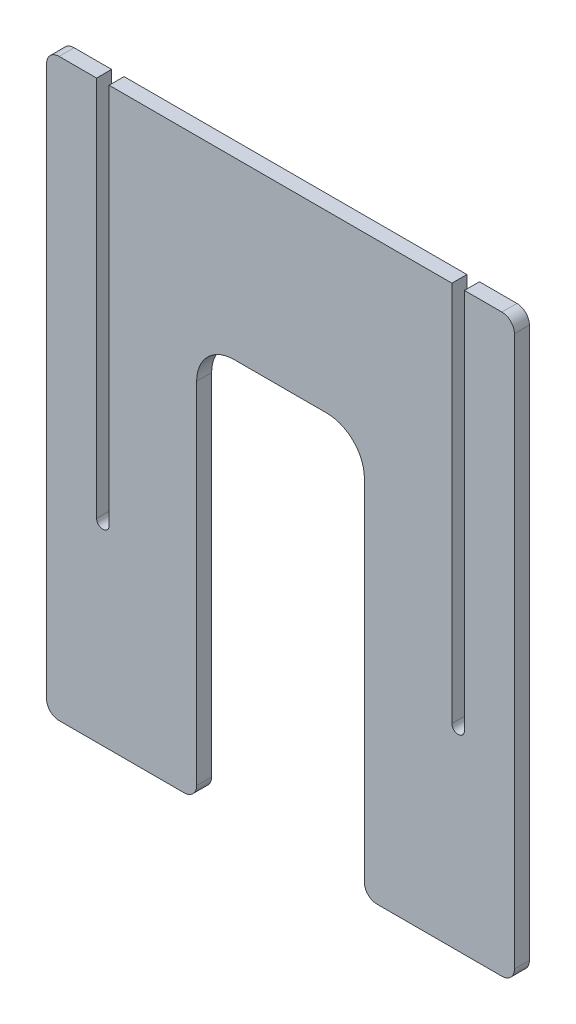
ISO-10303-21;
HEADER;
FILE_DESCRIPTION(('STEP AP214'),'2;1');
FILE_NAME('part.step','',(''),(''),'','','');
FILE_SCHEMA(('AUTOMOTIVE_DESIGN { 1 0 10303 214 1 1 1 1 }'));
ENDSEC;
DATA;
#1=APPLICATION_CONTEXT('core data for automotive mechanical design processes');
#2=APPLICATION_PROTOCOL_DEFINITION('international standard','automotive_design',2000,#1);
#3=PRODUCT_CONTEXT('',#1,'mechanical');
#4=PRODUCT('Part','Part','',(#3));
#5=PRODUCT_RELATED_PRODUCT_CATEGORY('part','',(#4));
#6=PRODUCT_DEFINITION_FORMATION('','',#4);
#7=PRODUCT_DEFINITION_CONTEXT('part definition',#1,'design');
#8=PRODUCT_DEFINITION('design','',#6,#7);
#9=PRODUCT_DEFINITION_SHAPE('','',#8);
#10=(LENGTH_UNIT() NAMED_UNIT(*) SI_UNIT(.MILLI.,.METRE.));
#11=(NAMED_UNIT(*) PLANE_ANGLE_UNIT() SI_UNIT($,.RADIAN.));
#12=(NAMED_UNIT(*) SI_UNIT($,.STERADIAN.) SOLID_ANGLE_UNIT());
#13=UNCERTAINTY_MEASURE_WITH_UNIT(LENGTH_MEASURE(1.E-05),#10,'distance_accuracy_value','');
#14=(GEOMETRIC_REPRESENTATION_CONTEXT(3) GLOBAL_UNCERTAINTY_ASSIGNED_CONTEXT((#13)) GLOBAL_UNIT_ASSIGNED_CONTEXT((#10,
#11,#12)) REPRESENTATION_CONTEXT('',''));
#15=CARTESIAN_POINT('',(0.,0.,0.));
#16=DIRECTION('',(0.,0.,1.));
#17=DIRECTION('',(1.,0.,0.));
#18=AXIS2_PLACEMENT_3D('',#15,#16,#17);
#19=CARTESIAN_POINT('',(210.85782234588,-283.451425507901,12.));
#20=DIRECTION('',(0.,0.,-1.));
#21=DIRECTION('',(-1.,0.,0.));
#22=AXIS2_PLACEMENT_3D('',#19,#20,#21);
#23=CYLINDRICAL_SURFACE('',#22,4.99999999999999);
#24=CARTESIAN_POINT('',(210.85782234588,-283.451425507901,0.));
#25=DIRECTION('',(0.,0.,1.));
#26=DIRECTION('',(1.,0.,0.));
#27=AXIS2_PLACEMENT_3D('',#24,#25,#26);
#28=CIRCLE('',#27,4.99999999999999);
#29=CARTESIAN_POINT('',(205.85782234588,-283.451425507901,0.));
#30=VERTEX_POINT('',#29);
#31=CARTESIAN_POINT('',(215.85782234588,-283.451425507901,0.));
#32=VERTEX_POINT('',#31);
#33=EDGE_CURVE('E199',#30,#32,#28,.T.);
#34=ORIENTED_EDGE('',*,*,#33,.F.);
#35=DIRECTION('',(0.,0.,-1.));
#36=VECTOR('',#35,1.);
#37=CARTESIAN_POINT('',(205.85782234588,-283.451425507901,12.));
#38=LINE('',#37,#36);
#39=CARTESIAN_POINT('',(205.85782234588,-283.451425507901,12.));
#40=VERTEX_POINT('',#39);
#41=EDGE_CURVE('E195',#40,#30,#38,.T.);
#42=ORIENTED_EDGE('',*,*,#41,.F.);
#43=CARTESIAN_POINT('',(210.85782234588,-283.451425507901,12.));
#44=DIRECTION('',(0.,0.,1.));
#45=DIRECTION('',(1.,0.,0.));
#46=AXIS2_PLACEMENT_3D('',#43,#44,#45);
#47=CIRCLE('',#46,4.99999999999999);
#48=CARTESIAN_POINT('',(215.85782234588,-283.451425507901,12.));
#49=VERTEX_POINT('',#48);
#50=EDGE_CURVE('E197',#40,#49,#47,.T.);
#51=ORIENTED_EDGE('',*,*,#50,.T.);
#52=DIRECTION('',(0.,0.,-1.));
#53=VECTOR('',#52,1.);
#54=CARTESIAN_POINT('',(215.85782234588,-283.451425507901,12.));
#55=LINE('',#54,#53);
#56=EDGE_CURVE('E257',#49,#32,#55,.T.);
#57=ORIENTED_EDGE('',*,*,#56,.T.);
#58=EDGE_LOOP('',(#34,#42,#51,#57));
#59=FACE_BOUND('',#58,.T.);
#60=ADVANCED_FACE('F34',(#59),#23,.F.);
#61=CARTESIAN_POINT('',(205.85782234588,0.,12.));
#62=DIRECTION('',(1.,0.,0.));
#63=DIRECTION('',(0.,1.,0.));
#64=AXIS2_PLACEMENT_3D('',#61,#62,#63);
#65=PLANE('',#64);
#66=DIRECTION('',(0.,-1.,0.));
#67=VECTOR('',#66,1.);
#68=CARTESIAN_POINT('',(205.85782234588,0.,0.));
#69=LINE('',#68,#67);
#70=CARTESIAN_POINT('',(205.85782234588,21.5485744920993,0.));
#71=VERTEX_POINT('',#70);
#72=EDGE_CURVE('E259',#71,#30,#69,.T.);
#73=ORIENTED_EDGE('',*,*,#72,.F.);
#74=DIRECTION('',(0.,0.,-1.));
#75=VECTOR('',#74,1.);
#76=CARTESIAN_POINT('',(205.85782234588,21.5485744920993,12.));
#77=LINE('',#76,#75);
#78=CARTESIAN_POINT('',(205.85782234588,21.5485744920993,12.));
#79=VERTEX_POINT('',#78);
#80=EDGE_CURVE('E205',#79,#71,#77,.T.);
#81=ORIENTED_EDGE('',*,*,#80,.F.);
#82=DIRECTION('',(0.,-1.,0.));
#83=VECTOR('',#82,1.);
#84=CARTESIAN_POINT('',(205.85782234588,0.,12.));
#85=LINE('',#84,#83);
#86=EDGE_CURVE('E211',#79,#40,#85,.T.);
#87=ORIENTED_EDGE('',*,*,#86,.T.);
#88=ORIENTED_EDGE('',*,*,#41,.T.);
#89=EDGE_LOOP('',(#73,#81,#87,#88));
#90=FACE_BOUND('',#89,.T.);
#91=ADVANCED_FACE('F218',(#90),#65,.T.);
#92=CARTESIAN_POINT('',(0.,21.5485744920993,12.));
#93=DIRECTION('',(0.,-1.,0.));
#94=DIRECTION('',(0.,0.,-1.));
#95=AXIS2_PLACEMENT_3D('',#92,#93,#94);
#96=PLANE('',#95);
#97=DIRECTION('',(-1.,0.,0.));
#98=VECTOR('',#97,1.);
#99=CARTESIAN_POINT('',(0.,21.5485744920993,0.));
#100=LINE('',#99,#98);
#101=CARTESIAN_POINT('',(-68.2821776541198,21.5485744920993,0.));
#102=VERTEX_POINT('',#101);
#103=EDGE_CURVE('E261',#71,#102,#100,.T.);
#104=ORIENTED_EDGE('',*,*,#103,.T.);
#105=DIRECTION('',(0.,0.,-1.));
#106=VECTOR('',#105,1.);
#107=CARTESIAN_POINT('',(-68.2821776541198,21.5485744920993,12.));
#108=LINE('',#107,#106);
#109=CARTESIAN_POINT('',(-68.2821776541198,21.5485744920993,12.));
#110=VERTEX_POINT('',#109);
#111=EDGE_CURVE('E308',#110,#102,#108,.T.);
#112=ORIENTED_EDGE('',*,*,#111,.F.);
#113=DIRECTION('',(-1.,0.,0.));
#114=VECTOR('',#113,1.);
#115=CARTESIAN_POINT('',(0.,21.5485744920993,12.));
#116=LINE('',#115,#114);
#117=EDGE_CURVE('E220',#79,#110,#116,.T.);
#118=ORIENTED_EDGE('',*,*,#117,.F.);
#119=ORIENTED_EDGE('',*,*,#80,.T.);
#120=EDGE_LOOP('',(#104,#112,#118,#119));
#121=FACE_BOUND('',#120,.T.);
#122=ADVANCED_FACE('F441',(#121),#96,.F.);
#123=CARTESIAN_POINT('',(-68.2821776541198,0.,12.));
#124=DIRECTION('',(1.,0.,0.));
#125=DIRECTION('',(0.,0.,-1.));
#126=AXIS2_PLACEMENT_3D('',#123,#124,#125);
#127=PLANE('',#126);
#128=DIRECTION('',(0.,-1.,0.));
#129=VECTOR('',#128,1.);
#130=CARTESIAN_POINT('',(-68.2821776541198,0.,0.));
#131=LINE('',#130,#129);
#132=CARTESIAN_POINT('',(-68.2821776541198,-283.451425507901,0.));
#133=VERTEX_POINT('',#132);
#134=EDGE_CURVE('E263',#102,#133,#131,.T.);
#135=ORIENTED_EDGE('',*,*,#134,.T.);
#136=DIRECTION('',(0.,0.,-1.));
#137=VECTOR('',#136,1.);
#138=CARTESIAN_POINT('',(-68.2821776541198,-283.451425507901,12.));
#139=LINE('',#138,#137);
#140=CARTESIAN_POINT('',(-68.2821776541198,-283.451425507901,12.));
#141=VERTEX_POINT('',#140);
#142=EDGE_CURVE('E306',#141,#133,#139,.T.);
#143=ORIENTED_EDGE('',*,*,#142,.F.);
#144=DIRECTION('',(0.,-1.,0.));
#145=VECTOR('',#144,1.);
#146=CARTESIAN_POINT('',(-68.2821776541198,0.,12.));
#147=LINE('',#146,#145);
#148=EDGE_CURVE('E222',#110,#141,#147,.T.);
#149=ORIENTED_EDGE('',*,*,#148,.F.);
#150=ORIENTED_EDGE('',*,*,#111,.T.);
#151=EDGE_LOOP('',(#135,#143,#149,#150));
#152=FACE_BOUND('',#151,.T.);
#153=ADVANCED_FACE('F438',(#152),#127,.F.);
#154=CARTESIAN_POINT('',(-73.2821776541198,-283.451425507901,12.));
#155=DIRECTION('',(0.,0.,-1.));
#156=DIRECTION('',(-1.,0.,0.));
#157=AXIS2_PLACEMENT_3D('',#154,#155,#156);
#158=CYLINDRICAL_SURFACE('',#157,4.99999999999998);
#159=CARTESIAN_POINT('',(-73.2821776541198,-283.451425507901,0.));
#160=DIRECTION('',(0.,0.,1.));
#161=DIRECTION('',(1.,0.,0.));
#162=AXIS2_PLACEMENT_3D('',#159,#160,#161);
#163=CIRCLE('',#162,4.99999999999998);
#164=CARTESIAN_POINT('',(-78.2821776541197,-283.451425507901,0.));
#165=VERTEX_POINT('',#164);
#166=EDGE_CURVE('E266',#165,#133,#163,.T.);
#167=ORIENTED_EDGE('',*,*,#166,.F.);
#168=DIRECTION('',(0.,0.,-1.));
#169=VECTOR('',#168,1.);
#170=CARTESIAN_POINT('',(-78.2821776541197,-283.451425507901,12.));
#171=LINE('',#170,#169);
#172=CARTESIAN_POINT('',(-78.2821776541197,-283.451425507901,12.));
#173=VERTEX_POINT('',#172);
#174=EDGE_CURVE('E304',#173,#165,#171,.T.);
#175=ORIENTED_EDGE('',*,*,#174,.F.);
#176=CARTESIAN_POINT('',(-73.2821776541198,-283.451425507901,12.));
#177=DIRECTION('',(0.,0.,1.));
#178=DIRECTION('',(1.,0.,0.));
#179=AXIS2_PLACEMENT_3D('',#176,#177,#178);
#180=CIRCLE('',#179,4.99999999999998);
#181=EDGE_CURVE('E226',#173,#141,#180,.T.);
#182=ORIENTED_EDGE('',*,*,#181,.T.);
#183=ORIENTED_EDGE('',*,*,#142,.T.);
#184=EDGE_LOOP('',(#167,#175,#182,#183));
#185=FACE_BOUND('',#184,.T.);
#186=ADVANCED_FACE('F433',(#185),#158,.F.);
#187=CARTESIAN_POINT('',(-78.2821776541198,0.,12.));
#188=DIRECTION('',(1.,0.,0.));
#189=DIRECTION('',(0.,1.,0.));
#190=AXIS2_PLACEMENT_3D('',#187,#188,#189);
#191=PLANE('',#190);
#192=DIRECTION('',(0.,-1.,0.));
#193=VECTOR('',#192,1.);
#194=CARTESIAN_POINT('',(-78.2821776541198,0.,0.));
#195=LINE('',#194,#193);
#196=CARTESIAN_POINT('',(-78.2821776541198,21.5485744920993,0.));
#197=VERTEX_POINT('',#196);
#198=EDGE_CURVE('E269',#197,#165,#195,.T.);
#199=ORIENTED_EDGE('',*,*,#198,.F.);
#200=DIRECTION('',(0.,0.,-1.));
#201=VECTOR('',#200,1.);
#202=CARTESIAN_POINT('',(-78.2821776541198,21.5485744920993,12.));
#203=LINE('',#202,#201);
#204=CARTESIAN_POINT('',(-78.2821776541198,21.5485744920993,12.));
#205=VERTEX_POINT('',#204);
#206=EDGE_CURVE('E302',#205,#197,#203,.T.);
#207=ORIENTED_EDGE('',*,*,#206,.F.);
#208=DIRECTION('',(0.,-1.,0.));
#209=VECTOR('',#208,1.);
#210=CARTESIAN_POINT('',(-78.2821776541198,0.,12.));
#211=LINE('',#210,#209);
#212=EDGE_CURVE('E229',#205,#173,#211,.T.);
#213=ORIENTED_EDGE('',*,*,#212,.T.);
#214=ORIENTED_EDGE('',*,*,#174,.T.);
#215=EDGE_LOOP('',(#199,#207,#213,#214));
#216=FACE_BOUND('',#215,.T.);
#217=ADVANCED_FACE('F428',(#216),#191,.T.);
#218=CARTESIAN_POINT('',(0.,21.5485744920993,12.));
#219=DIRECTION('',(0.,-1.,0.));
#220=DIRECTION('',(1.,0.,0.));
#221=AXIS2_PLACEMENT_3D('',#218,#219,#220);
#222=PLANE('',#221);
#223=DIRECTION('',(-1.,0.,0.));
#224=VECTOR('',#223,1.);
#225=CARTESIAN_POINT('',(0.,21.5485744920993,0.));
#226=LINE('',#225,#224);
#227=CARTESIAN_POINT('',(-108.28217765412,21.5485744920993,0.));
#228=VERTEX_POINT('',#227);
#229=EDGE_CURVE('E272',#197,#228,#226,.T.);
#230=ORIENTED_EDGE('',*,*,#229,.T.);
#231=DIRECTION('',(0.,0.,-1.));
#232=VECTOR('',#231,1.);
#233=CARTESIAN_POINT('',(-108.28217765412,21.5485744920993,12.));
#234=LINE('',#233,#232);
#235=CARTESIAN_POINT('',(-108.28217765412,21.5485744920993,12.));
#236=VERTEX_POINT('',#235);
#237=EDGE_CURVE('E329',#228,#236,#234,.F.);
#238=ORIENTED_EDGE('',*,*,#237,.T.);
#239=DIRECTION('',(-1.,0.,0.));
#240=VECTOR('',#239,1.);
#241=CARTESIAN_POINT('',(0.,21.5485744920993,12.));
#242=LINE('',#241,#240);
#243=EDGE_CURVE('E232',#205,#236,#242,.T.);
#244=ORIENTED_EDGE('',*,*,#243,.F.);
#245=ORIENTED_EDGE('',*,*,#206,.T.);
#246=EDGE_LOOP('',(#230,#238,#244,#245));
#247=FACE_BOUND('',#246,.T.);
#248=ADVANCED_FACE('F424',(#247),#222,.F.);
#249=CARTESIAN_POINT('',(-118.28217765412,0.,12.));
#250=DIRECTION('',(1.,0.,0.));
#251=DIRECTION('',(0.,1.,0.));
#252=AXIS2_PLACEMENT_3D('',#249,#250,#251);
#253=PLANE('',#252);
#254=DIRECTION('',(0.,-1.,0.));
#255=VECTOR('',#254,1.);
#256=CARTESIAN_POINT('',(-118.28217765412,0.,12.));
#257=LINE('',#256,#255);
#258=CARTESIAN_POINT('',(-118.28217765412,11.5485744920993,12.));
#259=VERTEX_POINT('',#258);
#260=CARTESIAN_POINT('',(-118.28217765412,-428.451425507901,12.));
#261=VERTEX_POINT('',#260);
#262=EDGE_CURVE('E234',#259,#261,#257,.T.);
#263=ORIENTED_EDGE('',*,*,#262,.F.);
#264=DIRECTION('',(0.,0.,-1.));
#265=VECTOR('',#264,1.);
#266=CARTESIAN_POINT('',(-118.28217765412,11.5485744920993,12.));
#267=LINE('',#266,#265);
#268=CARTESIAN_POINT('',(-118.28217765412,11.5485744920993,0.));
#269=VERTEX_POINT('',#268);
#270=EDGE_CURVE('E313',#259,#269,#267,.T.);
#271=ORIENTED_EDGE('',*,*,#270,.T.);
#272=DIRECTION('',(0.,-1.,0.));
#273=VECTOR('',#272,1.);
#274=CARTESIAN_POINT('',(-118.28217765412,0.,0.));
#275=LINE('',#274,#273);
#276=CARTESIAN_POINT('',(-118.28217765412,-428.451425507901,0.));
#277=VERTEX_POINT('',#276);
#278=EDGE_CURVE('E275',#269,#277,#275,.T.);
#279=ORIENTED_EDGE('',*,*,#278,.T.);
#280=DIRECTION('',(0.,0.,-1.));
#281=VECTOR('',#280,1.);
#282=CARTESIAN_POINT('',(-118.28217765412,-428.451425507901,12.));
#283=LINE('',#282,#281);
#284=EDGE_CURVE('E204',#277,#261,#283,.F.);
#285=ORIENTED_EDGE('',*,*,#284,.T.);
#286=EDGE_LOOP('',(#263,#271,#279,#285));
#287=FACE_BOUND('',#286,.T.);
#288=ADVANCED_FACE('F415',(#287),#253,.F.);
#289=CARTESIAN_POINT('',(0.,-438.451425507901,12.));
#290=DIRECTION('',(0.,1.,0.));
#291=DIRECTION('',(0.,0.,1.));
#292=AXIS2_PLACEMENT_3D('',#289,#290,#291);
#293=PLANE('',#292);
#294=DIRECTION('',(1.,0.,0.));
#295=VECTOR('',#294,1.);
#296=CARTESIAN_POINT('',(0.,-438.451425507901,12.));
#297=LINE('',#296,#295);
#298=CARTESIAN_POINT('',(-108.28217765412,-438.451425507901,12.));
#299=VERTEX_POINT('',#298);
#300=CARTESIAN_POINT('',(-8.28217765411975,-438.451425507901,12.));
#301=VERTEX_POINT('',#300);
#302=EDGE_CURVE('E237',#299,#301,#297,.T.);
#303=ORIENTED_EDGE('',*,*,#302,.F.);
#304=DIRECTION('',(0.,0.,-1.));
#305=VECTOR('',#304,1.);
#306=CARTESIAN_POINT('',(-108.28217765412,-438.451425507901,12.));
#307=LINE('',#306,#305);
#308=CARTESIAN_POINT('',(-108.28217765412,-438.451425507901,0.));
#309=VERTEX_POINT('',#308);
#310=EDGE_CURVE('E345',#299,#309,#307,.T.);
#311=ORIENTED_EDGE('',*,*,#310,.T.);
#312=DIRECTION('',(1.,0.,0.));
#313=VECTOR('',#312,1.);
#314=CARTESIAN_POINT('',(0.,-438.451425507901,0.));
#315=LINE('',#314,#313);
#316=CARTESIAN_POINT('',(-8.28217765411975,-438.451425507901,0.));
#317=VERTEX_POINT('',#316);
#318=EDGE_CURVE('E278',#309,#317,#315,.T.);
#319=ORIENTED_EDGE('',*,*,#318,.T.);
#320=DIRECTION('',(0.,0.,-1.));
#321=VECTOR('',#320,1.);
#322=CARTESIAN_POINT('',(-8.28217765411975,-438.451425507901,12.));
#323=LINE('',#322,#321);
#324=EDGE_CURVE('E343',#317,#301,#323,.F.);
#325=ORIENTED_EDGE('',*,*,#324,.T.);
#326=EDGE_LOOP('',(#303,#311,#319,#325));
#327=FACE_BOUND('',#326,.T.);
#328=ADVANCED_FACE('F407',(#327),#293,.F.);
#329=CARTESIAN_POINT('',(1.71782234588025,0.,12.));
#330=DIRECTION('',(-1.,0.,0.));
#331=DIRECTION('',(0.,0.,1.));
#332=AXIS2_PLACEMENT_3D('',#329,#330,#331);
#333=PLANE('',#332);
#334=DIRECTION('',(0.,1.,0.));
#335=VECTOR('',#334,1.);
#336=CARTESIAN_POINT('',(1.71782234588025,0.,0.));
#337=LINE('',#336,#335);
#338=CARTESIAN_POINT('',(1.71782234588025,-428.451425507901,0.));
#339=VERTEX_POINT('',#338);
#340=CARTESIAN_POINT('',(1.71782234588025,-148.451425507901,0.));
#341=VERTEX_POINT('',#340);
#342=EDGE_CURVE('E281',#339,#341,#337,.T.);
#343=ORIENTED_EDGE('',*,*,#342,.T.);
#344=DIRECTION('',(0.,0.,-1.));
#345=VECTOR('',#344,1.);
#346=CARTESIAN_POINT('',(1.71782234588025,-148.451425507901,12.));
#347=LINE('',#346,#345);
#348=CARTESIAN_POINT('',(1.71782234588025,-148.451425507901,12.));
#349=VERTEX_POINT('',#348);
#350=EDGE_CURVE('E55',#341,#349,#347,.F.);
#351=ORIENTED_EDGE('',*,*,#350,.T.);
#352=DIRECTION('',(0.,1.,0.));
#353=VECTOR('',#352,1.);
#354=CARTESIAN_POINT('',(1.71782234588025,0.,12.));
#355=LINE('',#354,#353);
#356=CARTESIAN_POINT('',(1.71782234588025,-428.451425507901,12.));
#357=VERTEX_POINT('',#356);
#358=EDGE_CURVE('E240',#357,#349,#355,.T.);
#359=ORIENTED_EDGE('',*,*,#358,.F.);
#360=DIRECTION('',(0.,0.,-1.));
#361=VECTOR('',#360,1.);
#362=CARTESIAN_POINT('',(1.71782234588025,-428.451425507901,12.));
#363=LINE('',#362,#361);
#364=EDGE_CURVE('E356',#357,#339,#363,.T.);
#365=ORIENTED_EDGE('',*,*,#364,.T.);
#366=EDGE_LOOP('',(#343,#351,#359,#365));
#367=FACE_BOUND('',#366,.T.);
#368=ADVANCED_FACE('F400',(#367),#333,.F.);
#369=CARTESIAN_POINT('',(0.,-118.451425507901,12.));
#370=DIRECTION('',(0.,1.,0.));
#371=DIRECTION('',(0.,0.,1.));
#372=AXIS2_PLACEMENT_3D('',#369,#370,#371);
#373=PLANE('',#372);
#374=DIRECTION('',(1.,0.,0.));
#375=VECTOR('',#374,1.);
#376=CARTESIAN_POINT('',(0.,-118.451425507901,0.));
#377=LINE('',#376,#375);
#378=CARTESIAN_POINT('',(31.7178223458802,-118.451425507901,0.));
#379=VERTEX_POINT('',#378);
#380=CARTESIAN_POINT('',(105.85782234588,-118.451425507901,0.));
#381=VERTEX_POINT('',#380);
#382=EDGE_CURVE('E283',#379,#381,#377,.T.);
#383=ORIENTED_EDGE('',*,*,#382,.T.);
#384=DIRECTION('',(0.,0.,-1.));
#385=VECTOR('',#384,1.);
#386=CARTESIAN_POINT('',(105.85782234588,-118.451425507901,12.));
#387=LINE('',#386,#385);
#388=CARTESIAN_POINT('',(105.85782234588,-118.451425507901,12.));
#389=VERTEX_POINT('',#388);
#390=EDGE_CURVE('E373',#381,#389,#387,.F.);
#391=ORIENTED_EDGE('',*,*,#390,.T.);
#392=DIRECTION('',(1.,0.,0.));
#393=VECTOR('',#392,1.);
#394=CARTESIAN_POINT('',(0.,-118.451425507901,12.));
#395=LINE('',#394,#393);
#396=CARTESIAN_POINT('',(31.7178223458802,-118.451425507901,12.));
#397=VERTEX_POINT('',#396);
#398=EDGE_CURVE('E242',#397,#389,#395,.T.);
#399=ORIENTED_EDGE('',*,*,#398,.F.);
#400=DIRECTION('',(0.,0.,-1.));
#401=VECTOR('',#400,1.);
#402=CARTESIAN_POINT('',(31.7178223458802,-118.451425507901,0.));
#403=LINE('',#402,#401);
#404=EDGE_CURVE('E370',#397,#379,#403,.T.);
#405=ORIENTED_EDGE('',*,*,#404,.T.);
#406=EDGE_LOOP('',(#383,#391,#399,#405));
#407=FACE_BOUND('',#406,.T.);
#408=ADVANCED_FACE('F394',(#407),#373,.F.);
#409=CARTESIAN_POINT('',(135.85782234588,0.,12.));
#410=DIRECTION('',(1.,0.,0.));
#411=DIRECTION('',(0.,0.,-1.));
#412=AXIS2_PLACEMENT_3D('',#409,#410,#411);
#413=PLANE('',#412);
#414=DIRECTION('',(0.,-1.,0.));
#415=VECTOR('',#414,1.);
#416=CARTESIAN_POINT('',(135.85782234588,0.,12.));
#417=LINE('',#416,#415);
#418=CARTESIAN_POINT('',(135.85782234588,-148.451425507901,12.));
#419=VERTEX_POINT('',#418);
#420=CARTESIAN_POINT('',(135.85782234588,-428.451425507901,12.));
#421=VERTEX_POINT('',#420);
#422=EDGE_CURVE('E245',#419,#421,#417,.T.);
#423=ORIENTED_EDGE('',*,*,#422,.F.);
#424=DIRECTION('',(0.,0.,-1.));
#425=VECTOR('',#424,1.);
#426=CARTESIAN_POINT('',(135.85782234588,-148.451425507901,0.));
#427=LINE('',#426,#425);
#428=CARTESIAN_POINT('',(135.85782234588,-148.451425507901,0.));
#429=VERTEX_POINT('',#428);
#430=EDGE_CURVE('E367',#419,#429,#427,.T.);
#431=ORIENTED_EDGE('',*,*,#430,.T.);
#432=DIRECTION('',(0.,-1.,0.));
#433=VECTOR('',#432,1.);
#434=CARTESIAN_POINT('',(135.85782234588,0.,0.));
#435=LINE('',#434,#433);
#436=CARTESIAN_POINT('',(135.85782234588,-428.451425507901,0.));
#437=VERTEX_POINT('',#436);
#438=EDGE_CURVE('E286',#429,#437,#435,.T.);
#439=ORIENTED_EDGE('',*,*,#438,.T.);
#440=DIRECTION('',(0.,0.,-1.));
#441=VECTOR('',#440,1.);
#442=CARTESIAN_POINT('',(135.85782234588,-428.451425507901,12.));
#443=LINE('',#442,#441);
#444=EDGE_CURVE('E353',#437,#421,#443,.F.);
#445=ORIENTED_EDGE('',*,*,#444,.T.);
#446=EDGE_LOOP('',(#423,#431,#439,#445));
#447=FACE_BOUND('',#446,.T.);
#448=ADVANCED_FACE('F386',(#447),#413,.F.);
#449=CARTESIAN_POINT('',(0.,-438.451425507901,12.));
#450=DIRECTION('',(0.,-1.,0.));
#451=DIRECTION('',(0.,0.,-1.));
#452=AXIS2_PLACEMENT_3D('',#449,#450,#451);
#453=PLANE('',#452);
#454=DIRECTION('',(-1.,0.,0.));
#455=VECTOR('',#454,1.);
#456=CARTESIAN_POINT('',(0.,-438.451425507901,12.));
#457=LINE('',#456,#455);
#458=CARTESIAN_POINT('',(245.85782234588,-438.451425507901,12.));
#459=VERTEX_POINT('',#458);
#460=CARTESIAN_POINT('',(145.85782234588,-438.451425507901,12.));
#461=VERTEX_POINT('',#460);
#462=EDGE_CURVE('E247',#459,#461,#457,.T.);
#463=ORIENTED_EDGE('',*,*,#462,.T.);
#464=DIRECTION('',(0.,0.,-1.));
#465=VECTOR('',#464,1.);
#466=CARTESIAN_POINT('',(145.85782234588,-438.451425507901,0.));
#467=LINE('',#466,#465);
#468=CARTESIAN_POINT('',(145.85782234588,-438.451425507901,0.));
#469=VERTEX_POINT('',#468);
#470=EDGE_CURVE('E350',#461,#469,#467,.T.);
#471=ORIENTED_EDGE('',*,*,#470,.T.);
#472=DIRECTION('',(-1.,0.,0.));
#473=VECTOR('',#472,1.);
#474=CARTESIAN_POINT('',(0.,-438.451425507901,0.));
#475=LINE('',#474,#473);
#476=CARTESIAN_POINT('',(245.85782234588,-438.451425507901,0.));
#477=VERTEX_POINT('',#476);
#478=EDGE_CURVE('E288',#477,#469,#475,.T.);
#479=ORIENTED_EDGE('',*,*,#478,.F.);
#480=DIRECTION('',(0.,0.,-1.));
#481=VECTOR('',#480,1.);
#482=CARTESIAN_POINT('',(245.85782234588,-438.451425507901,12.));
#483=LINE('',#482,#481);
#484=EDGE_CURVE('E348',#477,#459,#483,.F.);
#485=ORIENTED_EDGE('',*,*,#484,.T.);
#486=EDGE_LOOP('',(#463,#471,#479,#485));
#487=FACE_BOUND('',#486,.T.);
#488=ADVANCED_FACE('F463',(#487),#453,.T.);
#489=CARTESIAN_POINT('',(255.85782234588,0.,12.));
#490=DIRECTION('',(1.,0.,0.));
#491=DIRECTION('',(0.,1.,0.));
#492=AXIS2_PLACEMENT_3D('',#489,#490,#491);
#493=PLANE('',#492);
#494=DIRECTION('',(0.,-1.,0.));
#495=VECTOR('',#494,1.);
#496=CARTESIAN_POINT('',(255.85782234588,0.,12.));
#497=LINE('',#496,#495);
#498=CARTESIAN_POINT('',(255.85782234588,11.5485744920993,12.));
#499=VERTEX_POINT('',#498);
#500=CARTESIAN_POINT('',(255.85782234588,-428.451425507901,12.));
#501=VERTEX_POINT('',#500);
#502=EDGE_CURVE('E250',#499,#501,#497,.T.);
#503=ORIENTED_EDGE('',*,*,#502,.T.);
#504=DIRECTION('',(0.,0.,-1.));
#505=VECTOR('',#504,1.);
#506=CARTESIAN_POINT('',(255.85782234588,-428.451425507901,12.));
#507=LINE('',#506,#505);
#508=CARTESIAN_POINT('',(255.85782234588,-428.451425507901,0.));
#509=VERTEX_POINT('',#508);
#510=EDGE_CURVE('E361',#501,#509,#507,.T.);
#511=ORIENTED_EDGE('',*,*,#510,.T.);
#512=DIRECTION('',(0.,-1.,0.));
#513=VECTOR('',#512,1.);
#514=CARTESIAN_POINT('',(255.85782234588,0.,0.));
#515=LINE('',#514,#513);
#516=CARTESIAN_POINT('',(255.85782234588,11.5485744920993,0.));
#517=VERTEX_POINT('',#516);
#518=EDGE_CURVE('E291',#517,#509,#515,.T.);
#519=ORIENTED_EDGE('',*,*,#518,.F.);
#520=DIRECTION('',(0.,0.,-1.));
#521=VECTOR('',#520,1.);
#522=CARTESIAN_POINT('',(255.85782234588,11.5485744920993,12.));
#523=LINE('',#522,#521);
#524=EDGE_CURVE('E359',#517,#499,#523,.F.);
#525=ORIENTED_EDGE('',*,*,#524,.T.);
#526=EDGE_LOOP('',(#503,#511,#519,#525));
#527=FACE_BOUND('',#526,.T.);
#528=ADVANCED_FACE('F454',(#527),#493,.T.);
#529=CARTESIAN_POINT('',(0.,21.5485744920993,12.));
#530=DIRECTION('',(0.,1.,0.));
#531=DIRECTION('',(0.,0.,1.));
#532=AXIS2_PLACEMENT_3D('',#529,#530,#531);
#533=PLANE('',#532);
#534=DIRECTION('',(1.,0.,0.));
#535=VECTOR('',#534,1.);
#536=CARTESIAN_POINT('',(0.,21.5485744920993,12.));
#537=LINE('',#536,#535);
#538=CARTESIAN_POINT('',(215.85782234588,21.5485744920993,12.));
#539=VERTEX_POINT('',#538);
#540=CARTESIAN_POINT('',(245.85782234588,21.5485744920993,12.));
#541=VERTEX_POINT('',#540);
#542=EDGE_CURVE('E253',#539,#541,#537,.T.);
#543=ORIENTED_EDGE('',*,*,#542,.T.);
#544=DIRECTION('',(0.,0.,-1.));
#545=VECTOR('',#544,1.);
#546=CARTESIAN_POINT('',(245.85782234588,21.5485744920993,12.));
#547=LINE('',#546,#545);
#548=CARTESIAN_POINT('',(245.85782234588,21.5485744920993,0.));
#549=VERTEX_POINT('',#548);
#550=EDGE_CURVE('E364',#541,#549,#547,.T.);
#551=ORIENTED_EDGE('',*,*,#550,.T.);
#552=DIRECTION('',(1.,0.,0.));
#553=VECTOR('',#552,1.);
#554=CARTESIAN_POINT('',(0.,21.5485744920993,0.));
#555=LINE('',#554,#553);
#556=CARTESIAN_POINT('',(215.85782234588,21.5485744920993,0.));
#557=VERTEX_POINT('',#556);
#558=EDGE_CURVE('E294',#557,#549,#555,.T.);
#559=ORIENTED_EDGE('',*,*,#558,.F.);
#560=DIRECTION('',(0.,0.,-1.));
#561=VECTOR('',#560,1.);
#562=CARTESIAN_POINT('',(215.85782234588,21.5485744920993,12.));
#563=LINE('',#562,#561);
#564=EDGE_CURVE('E300',#539,#557,#563,.T.);
#565=ORIENTED_EDGE('',*,*,#564,.F.);
#566=EDGE_LOOP('',(#543,#551,#559,#565));
#567=FACE_BOUND('',#566,.T.);
#568=ADVANCED_FACE('F446',(#567),#533,.T.);
#569=CARTESIAN_POINT('',(215.85782234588,0.,12.));
#570=DIRECTION('',(1.,0.,0.));
#571=DIRECTION('',(0.,0.,-1.));
#572=AXIS2_PLACEMENT_3D('',#569,#570,#571);
#573=PLANE('',#572);
#574=DIRECTION('',(0.,-1.,0.));
#575=VECTOR('',#574,1.);
#576=CARTESIAN_POINT('',(215.85782234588,0.,0.));
#577=LINE('',#576,#575);
#578=EDGE_CURVE('E216',#557,#32,#577,.T.);
#579=ORIENTED_EDGE('',*,*,#578,.T.);
#580=ORIENTED_EDGE('',*,*,#56,.F.);
#581=DIRECTION('',(0.,-1.,0.));
#582=VECTOR('',#581,1.);
#583=CARTESIAN_POINT('',(215.85782234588,0.,12.));
#584=LINE('',#583,#582);
#585=EDGE_CURVE('E214',#539,#49,#584,.T.);
#586=ORIENTED_EDGE('',*,*,#585,.F.);
#587=ORIENTED_EDGE('',*,*,#564,.T.);
#588=EDGE_LOOP('',(#579,#580,#586,#587));
#589=FACE_BOUND('',#588,.T.);
#590=ADVANCED_FACE('F492',(#589),#573,.F.);
#591=CARTESIAN_POINT('',(0.,0.,12.));
#592=DIRECTION('',(0.,0.,1.));
#593=DIRECTION('',(1.,0.,0.));
#594=AXIS2_PLACEMENT_3D('',#591,#592,#593);
#595=PLANE('',#594);
#596=ORIENTED_EDGE('',*,*,#243,.T.);
#597=CARTESIAN_POINT('',(-108.28217765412,11.5485744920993,12.));
#598=DIRECTION('',(0.,0.,1.));
#599=DIRECTION('',(1.,0.,0.));
#600=AXIS2_PLACEMENT_3D('',#597,#598,#599);
#601=CIRCLE('',#600,10.);
#602=EDGE_CURVE('E341',#236,#259,#601,.T.);
#603=ORIENTED_EDGE('',*,*,#602,.T.);
#604=ORIENTED_EDGE('',*,*,#262,.T.);
#605=CARTESIAN_POINT('',(-108.28217765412,-428.451425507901,12.));
#606=DIRECTION('',(0.,0.,1.));
#607=DIRECTION('',(1.,0.,0.));
#608=AXIS2_PLACEMENT_3D('',#605,#606,#607);
#609=CIRCLE('',#608,10.);
#610=EDGE_CURVE('E339',#261,#299,#609,.T.);
#611=ORIENTED_EDGE('',*,*,#610,.T.);
#612=ORIENTED_EDGE('',*,*,#302,.T.);
#613=CARTESIAN_POINT('',(-8.28217765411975,-428.451425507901,12.));
#614=DIRECTION('',(0.,0.,1.));
#615=DIRECTION('',(1.,0.,0.));
#616=AXIS2_PLACEMENT_3D('',#613,#614,#615);
#617=CIRCLE('',#616,10.);
#618=EDGE_CURVE('E335',#301,#357,#617,.T.);
#619=ORIENTED_EDGE('',*,*,#618,.T.);
#620=ORIENTED_EDGE('',*,*,#358,.T.);
#621=CARTESIAN_POINT('',(31.7178223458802,-148.451425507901,12.));
#622=DIRECTION('',(0.,0.,1.));
#623=DIRECTION('',(1.,0.,0.));
#624=AXIS2_PLACEMENT_3D('',#621,#622,#623);
#625=CIRCLE('',#624,30.);
#626=EDGE_CURVE('E11',#349,#397,#625,.F.);
#627=ORIENTED_EDGE('',*,*,#626,.T.);
#628=ORIENTED_EDGE('',*,*,#398,.T.);
#629=CARTESIAN_POINT('',(105.85782234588,-148.451425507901,12.));
#630=DIRECTION('',(0.,0.,1.));
#631=DIRECTION('',(1.,0.,0.));
#632=AXIS2_PLACEMENT_3D('',#629,#630,#631);
#633=CIRCLE('',#632,30.);
#634=EDGE_CURVE('E378',#389,#419,#633,.F.);
#635=ORIENTED_EDGE('',*,*,#634,.T.);
#636=ORIENTED_EDGE('',*,*,#422,.T.);
#637=CARTESIAN_POINT('',(145.85782234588,-428.451425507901,12.));
#638=DIRECTION('',(0.,0.,1.));
#639=DIRECTION('',(1.,0.,0.));
#640=AXIS2_PLACEMENT_3D('',#637,#638,#639);
#641=CIRCLE('',#640,10.);
#642=EDGE_CURVE('E337',#421,#461,#641,.T.);
#643=ORIENTED_EDGE('',*,*,#642,.T.);
#644=ORIENTED_EDGE('',*,*,#462,.F.);
#645=CARTESIAN_POINT('',(245.85782234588,-428.451425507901,12.));
#646=DIRECTION('',(0.,0.,1.));
#647=DIRECTION('',(1.,0.,0.));
#648=AXIS2_PLACEMENT_3D('',#645,#646,#647);
#649=CIRCLE('',#648,10.);
#650=EDGE_CURVE('E333',#459,#501,#649,.T.);
#651=ORIENTED_EDGE('',*,*,#650,.T.);
#652=ORIENTED_EDGE('',*,*,#502,.F.);
#653=CARTESIAN_POINT('',(245.85782234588,11.5485744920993,12.));
#654=DIRECTION('',(0.,0.,1.));
#655=DIRECTION('',(1.,0.,0.));
#656=AXIS2_PLACEMENT_3D('',#653,#654,#655);
#657=CIRCLE('',#656,10.);
#658=EDGE_CURVE('E331',#499,#541,#657,.T.);
#659=ORIENTED_EDGE('',*,*,#658,.T.);
#660=ORIENTED_EDGE('',*,*,#542,.F.);
#661=ORIENTED_EDGE('',*,*,#585,.T.);
#662=ORIENTED_EDGE('',*,*,#50,.F.);
#663=ORIENTED_EDGE('',*,*,#86,.F.);
#664=ORIENTED_EDGE('',*,*,#117,.T.);
#665=ORIENTED_EDGE('',*,*,#148,.T.);
#666=ORIENTED_EDGE('',*,*,#181,.F.);
#667=ORIENTED_EDGE('',*,*,#212,.F.);
#668=EDGE_LOOP('',(#596,#603,#604,#611,#612,#619,#620,#627,#628,#635,#636,#643,#644,#651,#652,
#659,#660,#661,#662,#663,#664,#665,#666,#667));
#669=FACE_BOUND('',#668,.T.);
#670=ADVANCED_FACE('F210',(#669),#595,.T.);
#671=CARTESIAN_POINT('',(0.,0.,0.));
#672=DIRECTION('',(0.,0.,1.));
#673=DIRECTION('',(1.,0.,0.));
#674=AXIS2_PLACEMENT_3D('',#671,#672,#673);
#675=PLANE('',#674);
#676=ORIENTED_EDGE('',*,*,#278,.F.);
#677=CARTESIAN_POINT('',(-108.28217765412,11.5485744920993,0.));
#678=DIRECTION('',(0.,0.,1.));
#679=DIRECTION('',(1.,0.,0.));
#680=AXIS2_PLACEMENT_3D('',#677,#678,#679);
#681=CIRCLE('',#680,10.);
#682=EDGE_CURVE('E327',#269,#228,#681,.F.);
#683=ORIENTED_EDGE('',*,*,#682,.T.);
#684=ORIENTED_EDGE('',*,*,#229,.F.);
#685=ORIENTED_EDGE('',*,*,#198,.T.);
#686=ORIENTED_EDGE('',*,*,#166,.T.);
#687=ORIENTED_EDGE('',*,*,#134,.F.);
#688=ORIENTED_EDGE('',*,*,#103,.F.);
#689=ORIENTED_EDGE('',*,*,#72,.T.);
#690=ORIENTED_EDGE('',*,*,#33,.T.);
#691=ORIENTED_EDGE('',*,*,#578,.F.);
#692=ORIENTED_EDGE('',*,*,#558,.T.);
#693=CARTESIAN_POINT('',(245.85782234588,11.5485744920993,0.));
#694=DIRECTION('',(0.,0.,1.));
#695=DIRECTION('',(1.,0.,0.));
#696=AXIS2_PLACEMENT_3D('',#693,#694,#695);
#697=CIRCLE('',#696,10.);
#698=EDGE_CURVE('E316',#549,#517,#697,.F.);
#699=ORIENTED_EDGE('',*,*,#698,.T.);
#700=ORIENTED_EDGE('',*,*,#518,.T.);
#701=CARTESIAN_POINT('',(245.85782234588,-428.451425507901,0.));
#702=DIRECTION('',(0.,0.,1.));
#703=DIRECTION('',(1.,0.,0.));
#704=AXIS2_PLACEMENT_3D('',#701,#702,#703);
#705=CIRCLE('',#704,10.);
#706=EDGE_CURVE('E318',#509,#477,#705,.F.);
#707=ORIENTED_EDGE('',*,*,#706,.T.);
#708=ORIENTED_EDGE('',*,*,#478,.T.);
#709=CARTESIAN_POINT('',(145.85782234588,-428.451425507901,0.));
#710=DIRECTION('',(0.,0.,1.));
#711=DIRECTION('',(1.,0.,0.));
#712=AXIS2_PLACEMENT_3D('',#709,#710,#711);
#713=CIRCLE('',#712,10.);
#714=EDGE_CURVE('E322',#469,#437,#713,.F.);
#715=ORIENTED_EDGE('',*,*,#714,.T.);
#716=ORIENTED_EDGE('',*,*,#438,.F.);
#717=CARTESIAN_POINT('',(105.85782234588,-148.451425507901,0.));
#718=DIRECTION('',(0.,0.,1.));
#719=DIRECTION('',(1.,0.,0.));
#720=AXIS2_PLACEMENT_3D('',#717,#718,#719);
#721=CIRCLE('',#720,30.);
#722=EDGE_CURVE('E376',#429,#381,#721,.T.);
#723=ORIENTED_EDGE('',*,*,#722,.T.);
#724=ORIENTED_EDGE('',*,*,#382,.F.);
#725=CARTESIAN_POINT('',(31.7178223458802,-148.451425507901,0.));
#726=DIRECTION('',(0.,0.,1.));
#727=DIRECTION('',(1.,0.,0.));
#728=AXIS2_PLACEMENT_3D('',#725,#726,#727);
#729=CIRCLE('',#728,30.);
#730=EDGE_CURVE('E42',#379,#341,#729,.T.);
#731=ORIENTED_EDGE('',*,*,#730,.T.);
#732=ORIENTED_EDGE('',*,*,#342,.F.);
#733=CARTESIAN_POINT('',(-8.28217765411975,-428.451425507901,0.));
#734=DIRECTION('',(0.,0.,1.));
#735=DIRECTION('',(1.,0.,0.));
#736=AXIS2_PLACEMENT_3D('',#733,#734,#735);
#737=CIRCLE('',#736,10.);
#738=EDGE_CURVE('E320',#339,#317,#737,.F.);
#739=ORIENTED_EDGE('',*,*,#738,.T.);
#740=ORIENTED_EDGE('',*,*,#318,.F.);
#741=CARTESIAN_POINT('',(-108.28217765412,-428.451425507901,0.));
#742=DIRECTION('',(0.,0.,1.));
#743=DIRECTION('',(1.,0.,0.));
#744=AXIS2_PLACEMENT_3D('',#741,#742,#743);
#745=CIRCLE('',#744,10.);
#746=EDGE_CURVE('E325',#309,#277,#745,.F.);
#747=ORIENTED_EDGE('',*,*,#746,.T.);
#748=EDGE_LOOP('',(#676,#683,#684,#685,#686,#687,#688,#689,#690,#691,#692,#699,#700,#707,#708,
#715,#716,#723,#724,#731,#732,#739,#740,#747));
#749=FACE_BOUND('',#748,.T.);
#750=ADVANCED_FACE('F392',(#749),#675,.F.);
#751=CARTESIAN_POINT('',(-108.28217765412,11.5485744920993,12.));
#752=DIRECTION('',(0.,0.,-1.));
#753=DIRECTION('',(-1.,0.,0.));
#754=AXIS2_PLACEMENT_3D('',#751,#752,#753);
#755=CYLINDRICAL_SURFACE('',#754,10.);
#756=ORIENTED_EDGE('',*,*,#602,.F.);
#757=ORIENTED_EDGE('',*,*,#237,.F.);
#758=ORIENTED_EDGE('',*,*,#682,.F.);
#759=ORIENTED_EDGE('',*,*,#270,.F.);
#760=EDGE_LOOP('',(#756,#757,#758,#759));
#761=FACE_BOUND('',#760,.T.);
#762=ADVANCED_FACE('F419',(#761),#755,.T.);
#763=CARTESIAN_POINT('',(-108.28217765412,-428.451425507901,12.));
#764=DIRECTION('',(0.,0.,-1.));
#765=DIRECTION('',(-1.,0.,0.));
#766=AXIS2_PLACEMENT_3D('',#763,#764,#765);
#767=CYLINDRICAL_SURFACE('',#766,10.);
#768=ORIENTED_EDGE('',*,*,#610,.F.);
#769=ORIENTED_EDGE('',*,*,#284,.F.);
#770=ORIENTED_EDGE('',*,*,#746,.F.);
#771=ORIENTED_EDGE('',*,*,#310,.F.);
#772=EDGE_LOOP('',(#768,#769,#770,#771));
#773=FACE_BOUND('',#772,.T.);
#774=ADVANCED_FACE('F411',(#773),#767,.T.);
#775=CARTESIAN_POINT('',(145.85782234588,-428.451425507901,12.));
#776=DIRECTION('',(0.,0.,1.));
#777=DIRECTION('',(1.,0.,0.));
#778=AXIS2_PLACEMENT_3D('',#775,#776,#777);
#779=CYLINDRICAL_SURFACE('',#778,10.);
#780=ORIENTED_EDGE('',*,*,#642,.F.);
#781=ORIENTED_EDGE('',*,*,#444,.F.);
#782=ORIENTED_EDGE('',*,*,#714,.F.);
#783=ORIENTED_EDGE('',*,*,#470,.F.);
#784=EDGE_LOOP('',(#780,#781,#782,#783));
#785=FACE_BOUND('',#784,.T.);
#786=ADVANCED_FACE('F467',(#785),#779,.T.);
#787=CARTESIAN_POINT('',(-8.28217765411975,-428.451425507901,12.));
#788=DIRECTION('',(0.,0.,-1.));
#789=DIRECTION('',(-1.,0.,0.));
#790=AXIS2_PLACEMENT_3D('',#787,#788,#789);
#791=CYLINDRICAL_SURFACE('',#790,10.);
#792=ORIENTED_EDGE('',*,*,#618,.F.);
#793=ORIENTED_EDGE('',*,*,#324,.F.);
#794=ORIENTED_EDGE('',*,*,#738,.F.);
#795=ORIENTED_EDGE('',*,*,#364,.F.);
#796=EDGE_LOOP('',(#792,#793,#794,#795));
#797=FACE_BOUND('',#796,.T.);
#798=ADVANCED_FACE('F402',(#797),#791,.T.);
#799=CARTESIAN_POINT('',(245.85782234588,-428.451425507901,12.));
#800=DIRECTION('',(0.,0.,-1.));
#801=DIRECTION('',(-1.,0.,0.));
#802=AXIS2_PLACEMENT_3D('',#799,#800,#801);
#803=CYLINDRICAL_SURFACE('',#802,10.);
#804=ORIENTED_EDGE('',*,*,#650,.F.);
#805=ORIENTED_EDGE('',*,*,#484,.F.);
#806=ORIENTED_EDGE('',*,*,#706,.F.);
#807=ORIENTED_EDGE('',*,*,#510,.F.);
#808=EDGE_LOOP('',(#804,#805,#806,#807));
#809=FACE_BOUND('',#808,.T.);
#810=ADVANCED_FACE('F459',(#809),#803,.T.);
#811=CARTESIAN_POINT('',(245.85782234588,11.5485744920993,12.));
#812=DIRECTION('',(0.,0.,-1.));
#813=DIRECTION('',(-1.,0.,0.));
#814=AXIS2_PLACEMENT_3D('',#811,#812,#813);
#815=CYLINDRICAL_SURFACE('',#814,10.);
#816=ORIENTED_EDGE('',*,*,#658,.F.);
#817=ORIENTED_EDGE('',*,*,#524,.F.);
#818=ORIENTED_EDGE('',*,*,#698,.F.);
#819=ORIENTED_EDGE('',*,*,#550,.F.);
#820=EDGE_LOOP('',(#816,#817,#818,#819));
#821=FACE_BOUND('',#820,.T.);
#822=ADVANCED_FACE('F450',(#821),#815,.T.);
#823=CARTESIAN_POINT('',(105.85782234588,-148.451425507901,12.));
#824=DIRECTION('',(0.,0.,1.));
#825=DIRECTION('',(1.,0.,0.));
#826=AXIS2_PLACEMENT_3D('',#823,#824,#825);
#827=CYLINDRICAL_SURFACE('',#826,30.);
#828=ORIENTED_EDGE('',*,*,#634,.F.);
#829=ORIENTED_EDGE('',*,*,#390,.F.);
#830=ORIENTED_EDGE('',*,*,#722,.F.);
#831=ORIENTED_EDGE('',*,*,#430,.F.);
#832=EDGE_LOOP('',(#828,#829,#830,#831));
#833=FACE_BOUND('',#832,.T.);
#834=ADVANCED_FACE('F390',(#833),#827,.F.);
#835=CARTESIAN_POINT('',(31.7178223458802,-148.451425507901,12.));
#836=DIRECTION('',(0.,0.,1.));
#837=DIRECTION('',(1.,0.,0.));
#838=AXIS2_PLACEMENT_3D('',#835,#836,#837);
#839=CYLINDRICAL_SURFACE('',#838,30.);
#840=ORIENTED_EDGE('',*,*,#626,.F.);
#841=ORIENTED_EDGE('',*,*,#350,.F.);
#842=ORIENTED_EDGE('',*,*,#730,.F.);
#843=ORIENTED_EDGE('',*,*,#404,.F.);
#844=EDGE_LOOP('',(#840,#841,#842,#843));
#845=FACE_BOUND('',#844,.T.);
#846=ADVANCED_FACE('F36',(#845),#839,.F.);
#847=CLOSED_SHELL('',(#60,#91,#122,#153,#186,#217,#248,#288,#328,#368,#408,#448,#488,#528,#568,
#590,#670,#750,#762,#774,#786,#798,#810,#822,#834,#846));
#848=MANIFOLD_SOLID_BREP('B2',#847);
#849=ADVANCED_BREP_SHAPE_REPRESENTATION('',(#18,#848),#14);
#850=SHAPE_DEFINITION_REPRESENTATION(#9,#849);
ENDSEC;
END-ISO-10303-21;
